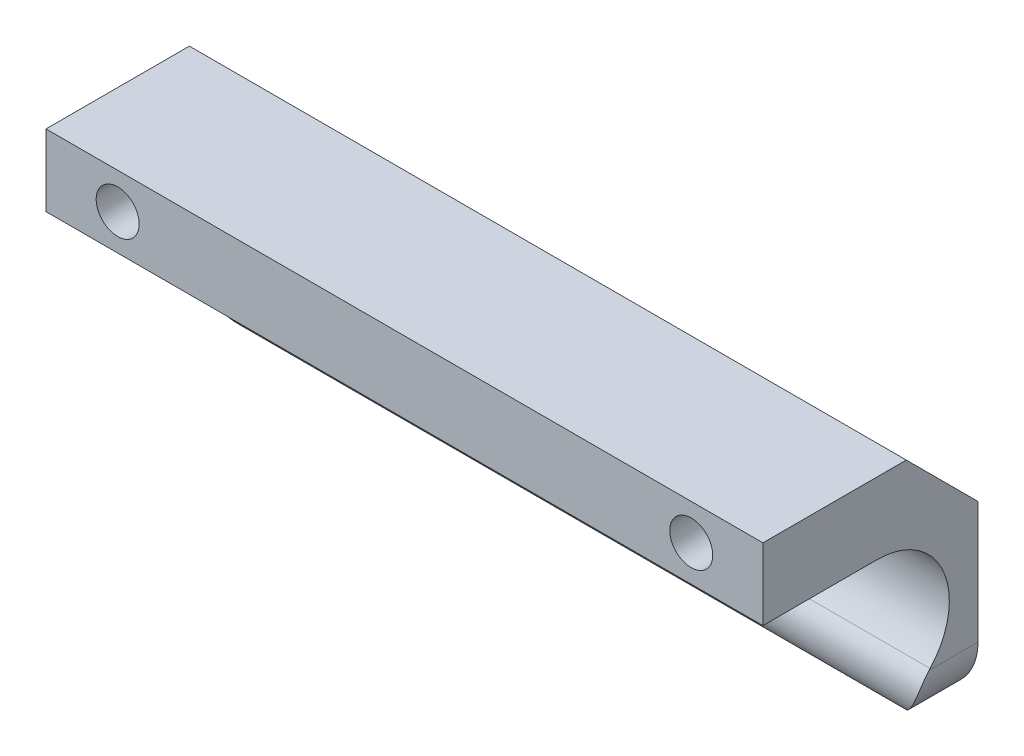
from build123d import *

# Parameters (mm, degrees)
SKETCH1_W      = 30
SKETCH1_H      = 35
EXTRUDE1_DEPTH = 50
CHAMFER1_SIZE  = 10
EXTRUDE2_DEPTH = 100
EXTRUDE3_DEPTH = 61.878978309


with BuildPart() as part:
    # Sketch1 → Extrude1 (new, symmetric)
    with BuildSketch(Plane(origin=(0, 0, 0), x_dir=(0, 0, -1), z_dir=(1, 0, 0))):
        Rectangle(SKETCH1_W, SKETCH1_H)
    extrude(amount=EXTRUDE1_DEPTH, both=True)

    # Chamfer1
    chamfer1_edges = [part.edges().sort_by_distance(p)[0] for p in [
        (0, 17.5, -15),
    ]]
    chamfer(chamfer1_edges, length=CHAMFER1_SIZE)

    # Sketch2 → Extrude2 (cut)
    with BuildSketch(Plane(origin=(50, 0, 0), x_dir=(0, 0, -1), z_dir=(1, 0, 0))):
        with BuildLine():
            ThreePointArc((8.30782305, -9.326105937), (10.172269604, 1.483650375), (1, 7.5))
            Line((1, 7.5), (-15, 7.5))
            Line((-15, 7.5), (-15, -17.5))
            Line((-15, -17.5), (11.857864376, -17.5))
            ThreePointArc((11.857864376, -17.5), (7.4021002, -14.577338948), (8.30782305, -9.326105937))
        make_face()
        with BuildLine():
            ThreePointArc((15, -16.346974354), (13.531370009, -17.202642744), (11.857864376, -17.5))
            Line((11.857864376, -17.5), (15, -17.5))
            Line((15, -17.5), (15, -16.346974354))
        make_face()
    extrude(amount=-EXTRUDE2_DEPTH, mode=Mode.SUBTRACT)

    # Sketch3 → Extrude3 (cut, through all)
    with BuildSketch(Plane(origin=(0, 0, -15), x_dir=(-1, 0, 0), z_dir=(0, 0, -1))):
        with BuildLine():
            Line((-50, -17.5), (-50, -9.5))
            ThreePointArc((-50, -9.5), (-47.656854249, -15.156854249), (-42, -17.5))
            Line((-42, -17.5), (-50, -17.5))
        make_face()
        with BuildLine():
            Line((50, -17.5), (50, -9.5))
            ThreePointArc((50, -9.5), (47.656854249, -15.156854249), (42, -17.5))
            Line((42, -17.5), (50, -17.5))
        make_face()
    extrude(amount=-EXTRUDE3_DEPTH, mode=Mode.SUBTRACT)

    # Sketch4 → M6x1.0 Tapped Hole1 (revolve, cut)
    with BuildSketch(Plane(origin=(-40, 12.5, 15), x_dir=(0, -1, 0), z_dir=(1, 0, 0))):
        Polygon((0, 0), (0, 18.502151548), (2.5, 17), (2.5, 12), (3, 12), (3, 0), align=None)
    m6x1_0_tapped_hole1 = revolve(axis=Axis((-40, 12.5, 21.35), (0, 0, -1)), mode=Mode.SUBTRACT)

    # Mirror1: M6x1.0 Tapped Hole1 across plane
    add(m6x1_0_tapped_hole1.mirror(Plane(origin=(0, 0, 0), x_dir=(0, 0, 1), z_dir=(1, 0, 0))), mode=Mode.SUBTRACT)


solid = part.part
